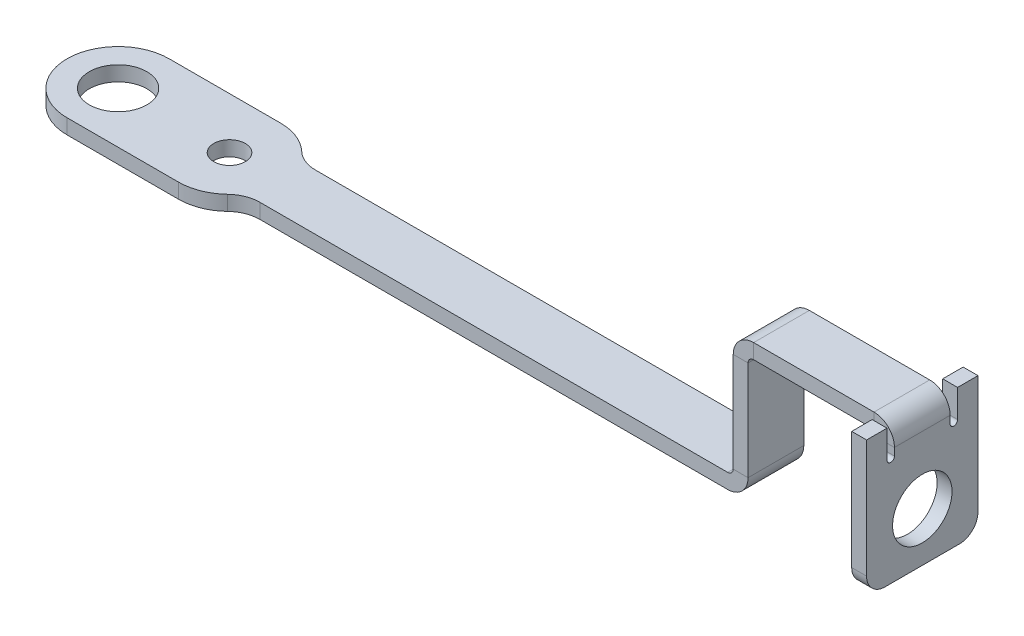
ISO-10303-21;
HEADER;
FILE_DESCRIPTION(('STEP AP214'),'2;1');
FILE_NAME('part.step','',(''),(''),'','','');
FILE_SCHEMA(('AUTOMOTIVE_DESIGN { 1 0 10303 214 1 1 1 1 }'));
ENDSEC;
DATA;
#1=APPLICATION_CONTEXT('core data for automotive mechanical design processes');
#2=APPLICATION_PROTOCOL_DEFINITION('international standard','automotive_design',2000,#1);
#3=PRODUCT_CONTEXT('',#1,'mechanical');
#4=PRODUCT('Part','Part','',(#3));
#5=PRODUCT_RELATED_PRODUCT_CATEGORY('part','',(#4));
#6=PRODUCT_DEFINITION_FORMATION('','',#4);
#7=PRODUCT_DEFINITION_CONTEXT('part definition',#1,'design');
#8=PRODUCT_DEFINITION('design','',#6,#7);
#9=PRODUCT_DEFINITION_SHAPE('','',#8);
#10=(LENGTH_UNIT() NAMED_UNIT(*) SI_UNIT(.MILLI.,.METRE.));
#11=(NAMED_UNIT(*) PLANE_ANGLE_UNIT() SI_UNIT($,.RADIAN.));
#12=(NAMED_UNIT(*) SI_UNIT($,.STERADIAN.) SOLID_ANGLE_UNIT());
#13=UNCERTAINTY_MEASURE_WITH_UNIT(LENGTH_MEASURE(1.E-05),#10,'distance_accuracy_value','');
#14=(GEOMETRIC_REPRESENTATION_CONTEXT(3) GLOBAL_UNCERTAINTY_ASSIGNED_CONTEXT((#13)) GLOBAL_UNIT_ASSIGNED_CONTEXT((#10,
#11,#12)) REPRESENTATION_CONTEXT('',''));
#15=CARTESIAN_POINT('',(0.,0.,0.));
#16=DIRECTION('',(0.,0.,1.));
#17=DIRECTION('',(1.,0.,0.));
#18=AXIS2_PLACEMENT_3D('',#15,#16,#17);
#19=CARTESIAN_POINT('',(-45.25,0.0500000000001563,2.74999999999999));
#20=DIRECTION('',(0.,0.,-1.));
#21=DIRECTION('',(-1.,0.,0.));
#22=AXIS2_PLACEMENT_3D('',#19,#20,#21);
#23=PLANE('',#22);
#24=DIRECTION('',(1.,0.,0.));
#25=VECTOR('',#24,1.);
#26=CARTESIAN_POINT('',(-45.25,0.850000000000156,2.74999999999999));
#27=LINE('',#26,#25);
#28=CARTESIAN_POINT('',(-36.5,0.850000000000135,2.75));
#29=VERTEX_POINT('',#28);
#30=CARTESIAN_POINT('',(-42.5,0.850000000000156,2.75));
#31=VERTEX_POINT('',#30);
#32=EDGE_CURVE('E639',#29,#31,#27,.F.);
#33=ORIENTED_EDGE('',*,*,#32,.T.);
#34=DIRECTION('',(0.,-1.,0.));
#35=VECTOR('',#34,1.);
#36=CARTESIAN_POINT('',(-42.5,7.60000000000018,2.75));
#37=LINE('',#36,#35);
#38=CARTESIAN_POINT('',(-42.5,0.0500000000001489,2.74999999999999));
#39=VERTEX_POINT('',#38);
#40=EDGE_CURVE('E611',#31,#39,#37,.T.);
#41=ORIENTED_EDGE('',*,*,#40,.T.);
#42=DIRECTION('',(-1.,0.,0.));
#43=VECTOR('',#42,1.);
#44=CARTESIAN_POINT('',(0.,0.0500000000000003,2.75));
#45=LINE('',#44,#43);
#46=CARTESIAN_POINT('',(-36.5000000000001,0.0500000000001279,2.75));
#47=VERTEX_POINT('',#46);
#48=EDGE_CURVE('E635',#47,#39,#45,.T.);
#49=ORIENTED_EDGE('',*,*,#48,.F.);
#50=DIRECTION('',(0.,-1.,0.));
#51=VECTOR('',#50,1.);
#52=CARTESIAN_POINT('',(-36.5,7.60000000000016,2.75));
#53=LINE('',#52,#51);
#54=EDGE_CURVE('E614',#29,#47,#53,.T.);
#55=ORIENTED_EDGE('',*,*,#54,.F.);
#56=EDGE_LOOP('',(#33,#41,#49,#55));
#57=FACE_BOUND('',#56,.T.);
#58=ADVANCED_FACE('F261',(#57),#23,.F.);
#59=CARTESIAN_POINT('',(0.,0.0500000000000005,0.));
#60=DIRECTION('',(0.,1.,0.));
#61=DIRECTION('',(-1.,0.,0.));
#62=AXIS2_PLACEMENT_3D('',#59,#60,#61);
#63=PLANE('',#62);
#64=CARTESIAN_POINT('',(-36.5000000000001,0.0500000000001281,0.));
#65=DIRECTION('',(0.,-1.,0.));
#66=DIRECTION('',(1.,0.,0.));
#67=AXIS2_PLACEMENT_3D('',#64,#65,#66);
#68=CIRCLE('',#67,0.849999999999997);
#69=CARTESIAN_POINT('',(-35.6500000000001,0.0500000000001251,0.));
#70=VERTEX_POINT('',#69);
#71=EDGE_CURVE('E625',#70,#70,#68,.T.);
#72=ORIENTED_EDGE('',*,*,#71,.F.);
#73=EDGE_LOOP('',(#72));
#74=FACE_BOUND('',#73,.T.);
#75=CARTESIAN_POINT('',(-42.5,0.0500000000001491,0.));
#76=DIRECTION('',(0.,-1.,0.));
#77=DIRECTION('',(1.,0.,0.));
#78=AXIS2_PLACEMENT_3D('',#75,#76,#77);
#79=CIRCLE('',#78,1.55);
#80=CARTESIAN_POINT('',(-40.95,0.0500000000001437,0.));
#81=VERTEX_POINT('',#80);
#82=EDGE_CURVE('E628',#81,#81,#79,.T.);
#83=ORIENTED_EDGE('',*,*,#82,.F.);
#84=EDGE_LOOP('',(#83));
#85=FACE_BOUND('',#84,.T.);
#86=CARTESIAN_POINT('',(-42.5,0.0500000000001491,0.));
#87=DIRECTION('',(0.,-1.,0.));
#88=DIRECTION('',(1.,0.,0.));
#89=AXIS2_PLACEMENT_3D('',#86,#87,#88);
#90=CIRCLE('',#89,2.74999999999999);
#91=CARTESIAN_POINT('',(-42.5,0.0500000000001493,-2.74999999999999));
#92=VERTEX_POINT('',#91);
#93=EDGE_CURVE('E623',#39,#92,#90,.T.);
#94=ORIENTED_EDGE('',*,*,#93,.T.);
#95=DIRECTION('',(-1.,0.,0.));
#96=VECTOR('',#95,1.);
#97=CARTESIAN_POINT('',(0.,0.0500000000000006,-2.75));
#98=LINE('',#97,#96);
#99=CARTESIAN_POINT('',(-36.5000000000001,0.0500000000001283,-2.75));
#100=VERTEX_POINT('',#99);
#101=EDGE_CURVE('E501',#100,#92,#98,.T.);
#102=ORIENTED_EDGE('',*,*,#101,.F.);
#103=CARTESIAN_POINT('',(-36.5000000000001,0.0500000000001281,0.));
#104=DIRECTION('',(0.,1.,0.));
#105=DIRECTION('',(1.,0.,0.));
#106=AXIS2_PLACEMENT_3D('',#103,#104,#105);
#107=CIRCLE('',#106,2.75);
#108=CARTESIAN_POINT('',(-34.6067361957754,0.0500000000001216,-1.99450549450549));
#109=VERTEX_POINT('',#108);
#110=EDGE_CURVE('E498',#109,#100,#107,.T.);
#111=ORIENTED_EDGE('',*,*,#110,.F.);
#112=CARTESIAN_POINT('',(-33.3675089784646,0.0500000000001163,-3.3));
#113=DIRECTION('',(0.,-1.,0.));
#114=DIRECTION('',(-1.,0.,0.));
#115=AXIS2_PLACEMENT_3D('',#112,#113,#114);
#116=CIRCLE('',#115,1.8);
#117=CARTESIAN_POINT('',(-33.3675089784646,0.0500000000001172,-1.5));
#118=VERTEX_POINT('',#117);
#119=EDGE_CURVE('E496',#118,#109,#116,.T.);
#120=ORIENTED_EDGE('',*,*,#119,.F.);
#121=DIRECTION('',(-1.,0.,0.));
#122=VECTOR('',#121,1.);
#123=CARTESIAN_POINT('',(-8.18000000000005,0.0500000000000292,-1.5));
#124=LINE('',#123,#122);
#125=CARTESIAN_POINT('',(-8.18000000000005,0.0500000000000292,-1.5));
#126=VERTEX_POINT('',#125);
#127=EDGE_CURVE('E486',#126,#118,#124,.T.);
#128=ORIENTED_EDGE('',*,*,#127,.F.);
#129=DIRECTION('',(0.,0.,1.));
#130=VECTOR('',#129,1.);
#131=CARTESIAN_POINT('',(-8.18000000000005,0.0500000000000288,1.5));
#132=LINE('',#131,#130);
#133=CARTESIAN_POINT('',(-8.18000000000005,0.050000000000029,1.5));
#134=VERTEX_POINT('',#133);
#135=EDGE_CURVE('E469',#126,#134,#132,.T.);
#136=ORIENTED_EDGE('',*,*,#135,.T.);
#137=DIRECTION('',(-1.,0.,0.));
#138=VECTOR('',#137,1.);
#139=CARTESIAN_POINT('',(-8.18000000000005,0.050000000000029,1.5));
#140=LINE('',#139,#138);
#141=CARTESIAN_POINT('',(-33.3675089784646,0.0500000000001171,1.5));
#142=VERTEX_POINT('',#141);
#143=EDGE_CURVE('E621',#134,#142,#140,.T.);
#144=ORIENTED_EDGE('',*,*,#143,.T.);
#145=CARTESIAN_POINT('',(-33.3675089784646,0.0500000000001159,3.3));
#146=DIRECTION('',(0.,1.,0.));
#147=DIRECTION('',(-1.,0.,0.));
#148=AXIS2_PLACEMENT_3D('',#145,#146,#147);
#149=CIRCLE('',#148,1.8);
#150=CARTESIAN_POINT('',(-34.6067361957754,0.0500000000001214,1.99450549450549));
#151=VERTEX_POINT('',#150);
#152=EDGE_CURVE('E761',#142,#151,#149,.T.);
#153=ORIENTED_EDGE('',*,*,#152,.T.);
#154=CARTESIAN_POINT('',(-36.5000000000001,0.0500000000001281,0.));
#155=DIRECTION('',(0.,-1.,0.));
#156=DIRECTION('',(1.,0.,0.));
#157=AXIS2_PLACEMENT_3D('',#154,#155,#156);
#158=CIRCLE('',#157,2.75);
#159=EDGE_CURVE('E617',#151,#47,#158,.T.);
#160=ORIENTED_EDGE('',*,*,#159,.T.);
#161=ORIENTED_EDGE('',*,*,#48,.T.);
#162=EDGE_LOOP('',(#94,#102,#111,#120,#128,#136,#144,#153,#160,#161));
#163=FACE_BOUND('',#162,.T.);
#164=ADVANCED_FACE('F493',(#74,#85,#163),#63,.F.);
#165=CARTESIAN_POINT('',(0.,0.850000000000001,0.));
#166=DIRECTION('',(0.,1.,0.));
#167=DIRECTION('',(-1.,0.,0.));
#168=AXIS2_PLACEMENT_3D('',#165,#166,#167);
#169=PLANE('',#168);
#170=CARTESIAN_POINT('',(-36.5,0.850000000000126,0.));
#171=DIRECTION('',(0.,1.,0.));
#172=DIRECTION('',(-1.,0.,0.));
#173=AXIS2_PLACEMENT_3D('',#170,#171,#172);
#174=CIRCLE('',#173,0.849999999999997);
#175=CARTESIAN_POINT('',(-37.3500000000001,0.850000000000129,0.));
#176=VERTEX_POINT('',#175);
#177=EDGE_CURVE('E753',#176,#176,#174,.T.);
#178=ORIENTED_EDGE('',*,*,#177,.F.);
#179=EDGE_LOOP('',(#178));
#180=FACE_BOUND('',#179,.T.);
#181=CARTESIAN_POINT('',(-42.5,0.850000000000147,0.));
#182=DIRECTION('',(0.,1.,0.));
#183=DIRECTION('',(-1.,0.,0.));
#184=AXIS2_PLACEMENT_3D('',#181,#182,#183);
#185=CIRCLE('',#184,1.55);
#186=CARTESIAN_POINT('',(-44.05,0.850000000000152,0.));
#187=VERTEX_POINT('',#186);
#188=EDGE_CURVE('E745',#187,#187,#185,.T.);
#189=ORIENTED_EDGE('',*,*,#188,.F.);
#190=EDGE_LOOP('',(#189));
#191=FACE_BOUND('',#190,.T.);
#192=DIRECTION('',(1.,0.,0.));
#193=VECTOR('',#192,1.);
#194=CARTESIAN_POINT('',(-45.25,0.850000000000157,-2.74999999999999));
#195=LINE('',#194,#193);
#196=CARTESIAN_POINT('',(-36.5,0.850000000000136,-2.75));
#197=VERTEX_POINT('',#196);
#198=CARTESIAN_POINT('',(-42.5,0.850000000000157,-2.75));
#199=VERTEX_POINT('',#198);
#200=EDGE_CURVE('E497',#197,#199,#195,.F.);
#201=ORIENTED_EDGE('',*,*,#200,.T.);
#202=CARTESIAN_POINT('',(-42.5,0.850000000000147,0.));
#203=DIRECTION('',(0.,1.,0.));
#204=DIRECTION('',(-1.,0.,0.));
#205=AXIS2_PLACEMENT_3D('',#202,#203,#204);
#206=CIRCLE('',#205,2.74999999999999);
#207=EDGE_CURVE('E631',#199,#31,#206,.T.);
#208=ORIENTED_EDGE('',*,*,#207,.T.);
#209=ORIENTED_EDGE('',*,*,#32,.F.);
#210=CARTESIAN_POINT('',(-36.5,0.850000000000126,0.));
#211=DIRECTION('',(0.,1.,0.));
#212=DIRECTION('',(-1.,0.,0.));
#213=AXIS2_PLACEMENT_3D('',#210,#211,#212);
#214=CIRCLE('',#213,2.75);
#215=CARTESIAN_POINT('',(-34.6067361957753,0.850000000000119,1.99450549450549));
#216=VERTEX_POINT('',#215);
#217=EDGE_CURVE('E748',#29,#216,#214,.T.);
#218=ORIENTED_EDGE('',*,*,#217,.T.);
#219=CARTESIAN_POINT('',(-33.3675089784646,0.850000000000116,3.3));
#220=DIRECTION('',(0.,1.,0.));
#221=DIRECTION('',(-1.,0.,0.));
#222=AXIS2_PLACEMENT_3D('',#219,#220,#221);
#223=CIRCLE('',#222,1.8);
#224=CARTESIAN_POINT('',(-33.3675089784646,0.850000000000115,1.5));
#225=VERTEX_POINT('',#224);
#226=EDGE_CURVE('E763',#216,#225,#223,.F.);
#227=ORIENTED_EDGE('',*,*,#226,.T.);
#228=DIRECTION('',(1.,0.,0.));
#229=VECTOR('',#228,1.);
#230=CARTESIAN_POINT('',(0.,0.85,1.5));
#231=LINE('',#230,#229);
#232=CARTESIAN_POINT('',(-8.18000000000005,0.850000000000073,1.5));
#233=VERTEX_POINT('',#232);
#234=EDGE_CURVE('E751',#225,#233,#231,.T.);
#235=ORIENTED_EDGE('',*,*,#234,.T.);
#236=DIRECTION('',(0.,0.,1.));
#237=VECTOR('',#236,1.);
#238=CARTESIAN_POINT('',(-8.18000000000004,0.850000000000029,0.));
#239=LINE('',#238,#237);
#240=CARTESIAN_POINT('',(-8.18000000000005,0.850000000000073,-1.5));
#241=VERTEX_POINT('',#240);
#242=EDGE_CURVE('E634',#241,#233,#239,.T.);
#243=ORIENTED_EDGE('',*,*,#242,.F.);
#244=DIRECTION('',(1.,0.,0.));
#245=VECTOR('',#244,1.);
#246=CARTESIAN_POINT('',(0.,0.850000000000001,-1.5));
#247=LINE('',#246,#245);
#248=CARTESIAN_POINT('',(-33.3675089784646,0.850000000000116,-1.5));
#249=VERTEX_POINT('',#248);
#250=EDGE_CURVE('E586',#249,#241,#247,.T.);
#251=ORIENTED_EDGE('',*,*,#250,.F.);
#252=CARTESIAN_POINT('',(-33.3675089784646,0.850000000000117,-3.3));
#253=DIRECTION('',(0.,-1.,0.));
#254=DIRECTION('',(-1.,0.,0.));
#255=AXIS2_PLACEMENT_3D('',#252,#253,#254);
#256=CIRCLE('',#255,1.8);
#257=CARTESIAN_POINT('',(-34.6067361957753,0.850000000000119,-1.99450549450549));
#258=VERTEX_POINT('',#257);
#259=EDGE_CURVE('E593',#258,#249,#256,.F.);
#260=ORIENTED_EDGE('',*,*,#259,.F.);
#261=CARTESIAN_POINT('',(-36.5,0.850000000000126,0.));
#262=DIRECTION('',(0.,-1.,0.));
#263=DIRECTION('',(-1.,0.,0.));
#264=AXIS2_PLACEMENT_3D('',#261,#262,#263);
#265=CIRCLE('',#264,2.75);
#266=EDGE_CURVE('E583',#197,#258,#265,.T.);
#267=ORIENTED_EDGE('',*,*,#266,.F.);
#268=EDGE_LOOP('',(#201,#208,#209,#218,#227,#235,#243,#251,#260,#267));
#269=FACE_BOUND('',#268,.T.);
#270=ADVANCED_FACE('F895',(#180,#191,#269),#169,.T.);
#271=CARTESIAN_POINT('',(-7.88,6.80000000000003,1.5));
#272=DIRECTION('',(0.,0.,-1.));
#273=DIRECTION('',(-1.,0.,0.));
#274=AXIS2_PLACEMENT_3D('',#271,#272,#273);
#275=PLANE('',#274);
#276=DIRECTION('',(1.,0.,0.));
#277=VECTOR('',#276,1.);
#278=CARTESIAN_POINT('',(-7.88000000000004,1.15000000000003,1.5));
#279=LINE('',#278,#277);
#280=CARTESIAN_POINT('',(-7.88000000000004,1.15000000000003,1.5));
#281=VERTEX_POINT('',#280);
#282=CARTESIAN_POINT('',(-7.08000000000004,1.15000000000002,1.5));
#283=VERTEX_POINT('',#282);
#284=EDGE_CURVE('E645',#281,#283,#279,.T.);
#285=ORIENTED_EDGE('',*,*,#284,.T.);
#286=DIRECTION('',(0.,-1.,0.));
#287=VECTOR('',#286,1.);
#288=CARTESIAN_POINT('',(-7.08,6.80000000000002,1.5));
#289=LINE('',#288,#287);
#290=CARTESIAN_POINT('',(-7.08,6.50000000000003,1.5));
#291=VERTEX_POINT('',#290);
#292=EDGE_CURVE('E657',#283,#291,#289,.F.);
#293=ORIENTED_EDGE('',*,*,#292,.T.);
#294=DIRECTION('',(1.,0.,0.));
#295=VECTOR('',#294,1.);
#296=CARTESIAN_POINT('',(-7.88000000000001,6.50000000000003,1.5));
#297=LINE('',#296,#295);
#298=CARTESIAN_POINT('',(-7.88000000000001,6.50000000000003,1.5));
#299=VERTEX_POINT('',#298);
#300=EDGE_CURVE('E653',#291,#299,#297,.F.);
#301=ORIENTED_EDGE('',*,*,#300,.T.);
#302=DIRECTION('',(0.,1.,0.));
#303=VECTOR('',#302,1.);
#304=CARTESIAN_POINT('',(-7.88000000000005,0.,1.5));
#305=LINE('',#304,#303);
#306=EDGE_CURVE('E654',#281,#299,#305,.T.);
#307=ORIENTED_EDGE('',*,*,#306,.F.);
#308=EDGE_LOOP('',(#285,#293,#301,#307));
#309=FACE_BOUND('',#308,.T.);
#310=ADVANCED_FACE('F840',(#309),#275,.F.);
#311=CARTESIAN_POINT('',(-7.88000000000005,0.,0.));
#312=DIRECTION('',(1.,0.,0.));
#313=DIRECTION('',(0.,1.,0.));
#314=AXIS2_PLACEMENT_3D('',#311,#312,#313);
#315=PLANE('',#314);
#316=DIRECTION('',(0.,0.,1.));
#317=VECTOR('',#316,1.);
#318=CARTESIAN_POINT('',(-7.88000000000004,1.15000000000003,1.5));
#319=LINE('',#318,#317);
#320=CARTESIAN_POINT('',(-7.88000000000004,1.15000000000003,-1.5));
#321=VERTEX_POINT('',#320);
#322=EDGE_CURVE('E479',#281,#321,#319,.F.);
#323=ORIENTED_EDGE('',*,*,#322,.F.);
#324=ORIENTED_EDGE('',*,*,#306,.T.);
#325=DIRECTION('',(0.,0.,-1.));
#326=VECTOR('',#325,1.);
#327=CARTESIAN_POINT('',(-7.88000000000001,6.50000000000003,1.5));
#328=LINE('',#327,#326);
#329=CARTESIAN_POINT('',(-7.88000000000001,6.50000000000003,-1.5));
#330=VERTEX_POINT('',#329);
#331=EDGE_CURVE('E659',#330,#299,#328,.F.);
#332=ORIENTED_EDGE('',*,*,#331,.F.);
#333=DIRECTION('',(0.,1.,0.));
#334=VECTOR('',#333,1.);
#335=CARTESIAN_POINT('',(-7.88000000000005,0.,-1.5));
#336=LINE('',#335,#334);
#337=EDGE_CURVE('E512',#321,#330,#336,.T.);
#338=ORIENTED_EDGE('',*,*,#337,.F.);
#339=EDGE_LOOP('',(#323,#324,#332,#338));
#340=FACE_BOUND('',#339,.T.);
#341=ADVANCED_FACE('F837',(#340),#315,.F.);
#342=CARTESIAN_POINT('',(-7.08000000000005,0.,0.));
#343=DIRECTION('',(1.,0.,0.));
#344=DIRECTION('',(0.,1.,0.));
#345=AXIS2_PLACEMENT_3D('',#342,#343,#344);
#346=PLANE('',#345);
#347=ORIENTED_EDGE('',*,*,#292,.F.);
#348=DIRECTION('',(0.,0.,1.));
#349=VECTOR('',#348,1.);
#350=CARTESIAN_POINT('',(-7.08000000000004,1.15000000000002,1.5));
#351=LINE('',#350,#349);
#352=CARTESIAN_POINT('',(-7.08000000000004,1.15000000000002,-1.5));
#353=VERTEX_POINT('',#352);
#354=EDGE_CURVE('E644',#283,#353,#351,.F.);
#355=ORIENTED_EDGE('',*,*,#354,.T.);
#356=DIRECTION('',(0.,-1.,0.));
#357=VECTOR('',#356,1.);
#358=CARTESIAN_POINT('',(-7.08,6.80000000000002,-1.5));
#359=LINE('',#358,#357);
#360=CARTESIAN_POINT('',(-7.08,6.50000000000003,-1.5));
#361=VERTEX_POINT('',#360);
#362=EDGE_CURVE('E516',#353,#361,#359,.F.);
#363=ORIENTED_EDGE('',*,*,#362,.T.);
#364=DIRECTION('',(0.,0.,-1.));
#365=VECTOR('',#364,1.);
#366=CARTESIAN_POINT('',(-7.08,6.50000000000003,1.5));
#367=LINE('',#366,#365);
#368=EDGE_CURVE('E662',#291,#361,#367,.T.);
#369=ORIENTED_EDGE('',*,*,#368,.F.);
#370=EDGE_LOOP('',(#347,#355,#363,#369));
#371=FACE_BOUND('',#370,.T.);
#372=ADVANCED_FACE('F847',(#371),#346,.T.);
#373=CARTESIAN_POINT('',(0.,7.6,1.5));
#374=DIRECTION('',(0.,0.,-1.));
#375=DIRECTION('',(-1.,0.,0.));
#376=AXIS2_PLACEMENT_3D('',#373,#374,#375);
#377=PLANE('',#376);
#378=DIRECTION('',(0.,1.,0.));
#379=VECTOR('',#378,1.);
#380=CARTESIAN_POINT('',(-6.78,6.80000000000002,1.5));
#381=LINE('',#380,#379);
#382=CARTESIAN_POINT('',(-6.78,6.80000000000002,1.5));
#383=VERTEX_POINT('',#382);
#384=CARTESIAN_POINT('',(-6.78,7.60000000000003,1.5));
#385=VERTEX_POINT('',#384);
#386=EDGE_CURVE('E672',#383,#385,#381,.T.);
#387=ORIENTED_EDGE('',*,*,#386,.F.);
#388=DIRECTION('',(-1.,0.,0.));
#389=VECTOR('',#388,1.);
#390=CARTESIAN_POINT('',(0.,6.8,1.5));
#391=LINE('',#390,#389);
#392=CARTESIAN_POINT('',(-0.299999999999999,6.8,1.5));
#393=VERTEX_POINT('',#392);
#394=EDGE_CURVE('E683',#383,#393,#391,.F.);
#395=ORIENTED_EDGE('',*,*,#394,.T.);
#396=DIRECTION('',(0.,-1.,0.));
#397=VECTOR('',#396,1.);
#398=CARTESIAN_POINT('',(-0.299999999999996,7.6,1.5));
#399=LINE('',#398,#397);
#400=CARTESIAN_POINT('',(-0.299999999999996,7.6,1.5));
#401=VERTEX_POINT('',#400);
#402=EDGE_CURVE('E679',#393,#401,#399,.F.);
#403=ORIENTED_EDGE('',*,*,#402,.T.);
#404=DIRECTION('',(1.,0.,0.));
#405=VECTOR('',#404,1.);
#406=CARTESIAN_POINT('',(0.,7.6,1.5));
#407=LINE('',#406,#405);
#408=EDGE_CURVE('E680',#385,#401,#407,.T.);
#409=ORIENTED_EDGE('',*,*,#408,.F.);
#410=EDGE_LOOP('',(#387,#395,#403,#409));
#411=FACE_BOUND('',#410,.T.);
#412=ADVANCED_FACE('F824',(#411),#377,.F.);
#413=CARTESIAN_POINT('',(0.,7.6,0.));
#414=DIRECTION('',(0.,-1.,0.));
#415=DIRECTION('',(1.,0.,0.));
#416=AXIS2_PLACEMENT_3D('',#413,#414,#415);
#417=PLANE('',#416);
#418=DIRECTION('',(0.,0.,-1.));
#419=VECTOR('',#418,1.);
#420=CARTESIAN_POINT('',(-6.78,7.60000000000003,0.));
#421=LINE('',#420,#419);
#422=CARTESIAN_POINT('',(-6.78,7.60000000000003,-1.5));
#423=VERTEX_POINT('',#422);
#424=EDGE_CURVE('E666',#423,#385,#421,.F.);
#425=ORIENTED_EDGE('',*,*,#424,.T.);
#426=ORIENTED_EDGE('',*,*,#408,.T.);
#427=DIRECTION('',(0.,0.,-1.));
#428=VECTOR('',#427,1.);
#429=CARTESIAN_POINT('',(-0.299999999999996,7.6,1.5));
#430=LINE('',#429,#428);
#431=CARTESIAN_POINT('',(-0.299999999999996,7.6,-1.5));
#432=VERTEX_POINT('',#431);
#433=EDGE_CURVE('E685',#432,#401,#430,.F.);
#434=ORIENTED_EDGE('',*,*,#433,.F.);
#435=DIRECTION('',(1.,0.,0.));
#436=VECTOR('',#435,1.);
#437=CARTESIAN_POINT('',(0.,7.6,-1.5));
#438=LINE('',#437,#436);
#439=EDGE_CURVE('E530',#423,#432,#438,.T.);
#440=ORIENTED_EDGE('',*,*,#439,.F.);
#441=EDGE_LOOP('',(#425,#426,#434,#440));
#442=FACE_BOUND('',#441,.T.);
#443=ADVANCED_FACE('F821',(#442),#417,.F.);
#444=CARTESIAN_POINT('',(0.,6.8,0.));
#445=DIRECTION('',(0.,-1.,0.));
#446=DIRECTION('',(1.,0.,0.));
#447=AXIS2_PLACEMENT_3D('',#444,#445,#446);
#448=PLANE('',#447);
#449=ORIENTED_EDGE('',*,*,#394,.F.);
#450=DIRECTION('',(0.,0.,-1.));
#451=VECTOR('',#450,1.);
#452=CARTESIAN_POINT('',(-6.78,6.80000000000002,0.));
#453=LINE('',#452,#451);
#454=CARTESIAN_POINT('',(-6.78,6.80000000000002,-1.5));
#455=VERTEX_POINT('',#454);
#456=EDGE_CURVE('E656',#455,#383,#453,.F.);
#457=ORIENTED_EDGE('',*,*,#456,.F.);
#458=DIRECTION('',(-1.,0.,0.));
#459=VECTOR('',#458,1.);
#460=CARTESIAN_POINT('',(0.,6.8,-1.5));
#461=LINE('',#460,#459);
#462=CARTESIAN_POINT('',(-0.299999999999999,6.8,-1.5));
#463=VERTEX_POINT('',#462);
#464=EDGE_CURVE('E534',#455,#463,#461,.F.);
#465=ORIENTED_EDGE('',*,*,#464,.T.);
#466=DIRECTION('',(0.,0.,-1.));
#467=VECTOR('',#466,1.);
#468=CARTESIAN_POINT('',(-0.299999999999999,6.8,1.5));
#469=LINE('',#468,#467);
#470=EDGE_CURVE('E688',#393,#463,#469,.T.);
#471=ORIENTED_EDGE('',*,*,#470,.F.);
#472=EDGE_LOOP('',(#449,#457,#465,#471));
#473=FACE_BOUND('',#472,.T.);
#474=ADVANCED_FACE('F860',(#473),#448,.T.);
#475=CARTESIAN_POINT('',(0.8,0.25,3.));
#476=DIRECTION('',(-1.,0.,0.));
#477=DIRECTION('',(0.,0.,1.));
#478=AXIS2_PLACEMENT_3D('',#475,#476,#477);
#479=PLANE('',#478);
#480=DIRECTION('',(0.,1.,0.));
#481=VECTOR('',#480,1.);
#482=CARTESIAN_POINT('',(0.8,0.25,-1.5));
#483=LINE('',#482,#481);
#484=CARTESIAN_POINT('',(0.8,6.1,-1.5));
#485=VERTEX_POINT('',#484);
#486=CARTESIAN_POINT('',(0.8,6.5,-1.5));
#487=VERTEX_POINT('',#486);
#488=EDGE_CURVE('E567',#485,#487,#483,.T.);
#489=ORIENTED_EDGE('',*,*,#488,.T.);
#490=DIRECTION('',(0.,0.,-1.));
#491=VECTOR('',#490,1.);
#492=CARTESIAN_POINT('',(0.8,6.5,0.));
#493=LINE('',#492,#491);
#494=CARTESIAN_POINT('',(0.8,6.5,1.5));
#495=VERTEX_POINT('',#494);
#496=EDGE_CURVE('E692',#487,#495,#493,.F.);
#497=ORIENTED_EDGE('',*,*,#496,.T.);
#498=DIRECTION('',(0.,1.,0.));
#499=VECTOR('',#498,1.);
#500=CARTESIAN_POINT('',(0.8,0.25,1.5));
#501=LINE('',#500,#499);
#502=CARTESIAN_POINT('',(0.8,6.1,1.5));
#503=VERTEX_POINT('',#502);
#504=EDGE_CURVE('E726',#503,#495,#501,.T.);
#505=ORIENTED_EDGE('',*,*,#504,.F.);
#506=CARTESIAN_POINT('',(0.8,6.1,1.7));
#507=DIRECTION('',(-1.,0.,0.));
#508=DIRECTION('',(0.,0.,1.));
#509=AXIS2_PLACEMENT_3D('',#506,#507,#508);
#510=CIRCLE('',#509,0.2);
#511=CARTESIAN_POINT('',(0.8,6.1,1.9));
#512=VERTEX_POINT('',#511);
#513=EDGE_CURVE('E724',#512,#503,#510,.F.);
#514=ORIENTED_EDGE('',*,*,#513,.F.);
#515=DIRECTION('',(0.,-1.,0.));
#516=VECTOR('',#515,1.);
#517=CARTESIAN_POINT('',(0.8,0.25,1.9));
#518=LINE('',#517,#516);
#519=CARTESIAN_POINT('',(0.8,7.6,1.9));
#520=VERTEX_POINT('',#519);
#521=EDGE_CURVE('E710',#520,#512,#518,.T.);
#522=ORIENTED_EDGE('',*,*,#521,.F.);
#523=DIRECTION('',(0.,0.,-1.));
#524=VECTOR('',#523,1.);
#525=CARTESIAN_POINT('',(0.8,7.6,3.));
#526=LINE('',#525,#524);
#527=CARTESIAN_POINT('',(0.8,7.6,3.));
#528=VERTEX_POINT('',#527);
#529=EDGE_CURVE('E742',#528,#520,#526,.T.);
#530=ORIENTED_EDGE('',*,*,#529,.F.);
#531=DIRECTION('',(0.,1.,0.));
#532=VECTOR('',#531,1.);
#533=CARTESIAN_POINT('',(0.8,0.25,3.));
#534=LINE('',#533,#532);
#535=CARTESIAN_POINT('',(0.8,1.25,3.));
#536=VERTEX_POINT('',#535);
#537=EDGE_CURVE('E728',#536,#528,#534,.T.);
#538=ORIENTED_EDGE('',*,*,#537,.F.);
#539=CARTESIAN_POINT('',(0.8,1.25,2.));
#540=DIRECTION('',(-1.,0.,0.));
#541=DIRECTION('',(0.,0.,1.));
#542=AXIS2_PLACEMENT_3D('',#539,#540,#541);
#543=CIRCLE('',#542,1.);
#544=CARTESIAN_POINT('',(0.8,0.25,2.));
#545=VERTEX_POINT('',#544);
#546=EDGE_CURVE('E15',#536,#545,#543,.F.);
#547=ORIENTED_EDGE('',*,*,#546,.T.);
#548=DIRECTION('',(0.,0.,-1.));
#549=VECTOR('',#548,1.);
#550=CARTESIAN_POINT('',(0.8,0.25,3.));
#551=LINE('',#550,#549);
#552=CARTESIAN_POINT('',(0.8,0.25,-2.));
#553=VERTEX_POINT('',#552);
#554=EDGE_CURVE('E735',#545,#553,#551,.T.);
#555=ORIENTED_EDGE('',*,*,#554,.T.);
#556=CARTESIAN_POINT('',(0.8,1.25,-2.));
#557=DIRECTION('',(1.,0.,0.));
#558=DIRECTION('',(0.,0.,-1.));
#559=AXIS2_PLACEMENT_3D('',#556,#557,#558);
#560=CIRCLE('',#559,1.);
#561=CARTESIAN_POINT('',(0.8,1.25,-3.));
#562=VERTEX_POINT('',#561);
#563=EDGE_CURVE('E604',#562,#553,#560,.F.);
#564=ORIENTED_EDGE('',*,*,#563,.F.);
#565=DIRECTION('',(0.,1.,0.));
#566=VECTOR('',#565,1.);
#567=CARTESIAN_POINT('',(0.8,0.25,-3.));
#568=LINE('',#567,#566);
#569=CARTESIAN_POINT('',(0.8,7.6,-3.));
#570=VERTEX_POINT('',#569);
#571=EDGE_CURVE('E570',#562,#570,#568,.T.);
#572=ORIENTED_EDGE('',*,*,#571,.T.);
#573=DIRECTION('',(0.,0.,1.));
#574=VECTOR('',#573,1.);
#575=CARTESIAN_POINT('',(0.8,7.6,-3.));
#576=LINE('',#575,#574);
#577=CARTESIAN_POINT('',(0.8,7.6,-1.9));
#578=VERTEX_POINT('',#577);
#579=EDGE_CURVE('E580',#570,#578,#576,.T.);
#580=ORIENTED_EDGE('',*,*,#579,.T.);
#581=DIRECTION('',(0.,-1.,0.));
#582=VECTOR('',#581,1.);
#583=CARTESIAN_POINT('',(0.8,0.25,-1.9));
#584=LINE('',#583,#582);
#585=CARTESIAN_POINT('',(0.8,6.1,-1.9));
#586=VERTEX_POINT('',#585);
#587=EDGE_CURVE('E551',#578,#586,#584,.T.);
#588=ORIENTED_EDGE('',*,*,#587,.T.);
#589=CARTESIAN_POINT('',(0.8,6.1,-1.7));
#590=DIRECTION('',(1.,0.,0.));
#591=DIRECTION('',(0.,0.,-1.));
#592=AXIS2_PLACEMENT_3D('',#589,#590,#591);
#593=CIRCLE('',#592,0.2);
#594=EDGE_CURVE('E564',#586,#485,#593,.F.);
#595=ORIENTED_EDGE('',*,*,#594,.T.);
#596=EDGE_LOOP('',(#489,#497,#505,#514,#522,#530,#538,#547,#555,#564,#572,#580,#588,#595));
#597=FACE_BOUND('',#596,.T.);
#598=CARTESIAN_POINT('',(0.8,2.9000000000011,-2.78943534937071E-12));
#599=DIRECTION('',(1.,0.,0.));
#600=DIRECTION('',(0.,0.,-1.));
#601=AXIS2_PLACEMENT_3D('',#598,#599,#600);
#602=CIRCLE('',#601,1.60000000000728);
#603=CARTESIAN_POINT('',(0.799999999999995,2.9000000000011,-1.60000000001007));
#604=VERTEX_POINT('',#603);
#605=EDGE_CURVE('E607',#604,#604,#602,.T.);
#606=ORIENTED_EDGE('',*,*,#605,.F.);
#607=EDGE_LOOP('',(#606));
#608=FACE_BOUND('',#607,.T.);
#609=ADVANCED_FACE('F785',(#597,#608),#479,.F.);
#610=CARTESIAN_POINT('',(0.,7.6,3.));
#611=DIRECTION('',(0.,1.,0.));
#612=DIRECTION('',(0.,0.,1.));
#613=AXIS2_PLACEMENT_3D('',#610,#611,#612);
#614=PLANE('',#613);
#615=ORIENTED_EDGE('',*,*,#529,.T.);
#616=DIRECTION('',(1.,0.,0.));
#617=VECTOR('',#616,1.);
#618=CARTESIAN_POINT('',(0.,7.6,1.9));
#619=LINE('',#618,#617);
#620=CARTESIAN_POINT('',(0.,7.6,1.9));
#621=VERTEX_POINT('',#620);
#622=EDGE_CURVE('E717',#621,#520,#619,.T.);
#623=ORIENTED_EDGE('',*,*,#622,.F.);
#624=DIRECTION('',(0.,0.,-1.));
#625=VECTOR('',#624,1.);
#626=CARTESIAN_POINT('',(0.,7.6,3.));
#627=LINE('',#626,#625);
#628=CARTESIAN_POINT('',(0.,7.6,3.));
#629=VERTEX_POINT('',#628);
#630=EDGE_CURVE('E739',#629,#621,#627,.T.);
#631=ORIENTED_EDGE('',*,*,#630,.F.);
#632=DIRECTION('',(1.,0.,0.));
#633=VECTOR('',#632,1.);
#634=CARTESIAN_POINT('',(0.,7.6,3.));
#635=LINE('',#634,#633);
#636=EDGE_CURVE('E730',#629,#528,#635,.T.);
#637=ORIENTED_EDGE('',*,*,#636,.T.);
#638=EDGE_LOOP('',(#615,#623,#631,#637));
#639=FACE_BOUND('',#638,.T.);
#640=ADVANCED_FACE('F874',(#639),#614,.T.);
#641=CARTESIAN_POINT('',(0.,0.25,3.));
#642=DIRECTION('',(-1.,0.,0.));
#643=DIRECTION('',(0.,0.,1.));
#644=AXIS2_PLACEMENT_3D('',#641,#642,#643);
#645=PLANE('',#644);
#646=DIRECTION('',(0.,0.,-1.));
#647=VECTOR('',#646,1.);
#648=CARTESIAN_POINT('',(0.,6.5,0.));
#649=LINE('',#648,#647);
#650=CARTESIAN_POINT('',(0.,6.5,-1.5));
#651=VERTEX_POINT('',#650);
#652=CARTESIAN_POINT('',(0.,6.5,1.5));
#653=VERTEX_POINT('',#652);
#654=EDGE_CURVE('E682',#651,#653,#649,.F.);
#655=ORIENTED_EDGE('',*,*,#654,.F.);
#656=DIRECTION('',(0.,-1.,0.));
#657=VECTOR('',#656,1.);
#658=CARTESIAN_POINT('',(0.,6.5,-1.5));
#659=LINE('',#658,#657);
#660=CARTESIAN_POINT('',(0.,6.1,-1.5));
#661=VERTEX_POINT('',#660);
#662=EDGE_CURVE('E548',#651,#661,#659,.T.);
#663=ORIENTED_EDGE('',*,*,#662,.T.);
#664=CARTESIAN_POINT('',(0.,6.1,-1.7));
#665=DIRECTION('',(1.,0.,0.));
#666=DIRECTION('',(0.,0.,-1.));
#667=AXIS2_PLACEMENT_3D('',#664,#665,#666);
#668=CIRCLE('',#667,0.2);
#669=CARTESIAN_POINT('',(0.,6.1,-1.9));
#670=VERTEX_POINT('',#669);
#671=EDGE_CURVE('E552',#661,#670,#668,.T.);
#672=ORIENTED_EDGE('',*,*,#671,.T.);
#673=DIRECTION('',(0.,1.,0.));
#674=VECTOR('',#673,1.);
#675=CARTESIAN_POINT('',(0.,6.1,-1.9));
#676=LINE('',#675,#674);
#677=CARTESIAN_POINT('',(0.,7.6,-1.9));
#678=VERTEX_POINT('',#677);
#679=EDGE_CURVE('E556',#670,#678,#676,.T.);
#680=ORIENTED_EDGE('',*,*,#679,.T.);
#681=DIRECTION('',(0.,0.,1.));
#682=VECTOR('',#681,1.);
#683=CARTESIAN_POINT('',(0.,7.6,-3.));
#684=LINE('',#683,#682);
#685=CARTESIAN_POINT('',(0.,7.6,-3.));
#686=VERTEX_POINT('',#685);
#687=EDGE_CURVE('E577',#686,#678,#684,.T.);
#688=ORIENTED_EDGE('',*,*,#687,.F.);
#689=DIRECTION('',(0.,1.,0.));
#690=VECTOR('',#689,1.);
#691=CARTESIAN_POINT('',(0.,0.25,-3.));
#692=LINE('',#691,#690);
#693=CARTESIAN_POINT('',(0.,1.25,-3.));
#694=VERTEX_POINT('',#693);
#695=EDGE_CURVE('E575',#694,#686,#692,.T.);
#696=ORIENTED_EDGE('',*,*,#695,.F.);
#697=CARTESIAN_POINT('',(0.,1.25,-2.));
#698=DIRECTION('',(1.,0.,0.));
#699=DIRECTION('',(0.,0.,-1.));
#700=AXIS2_PLACEMENT_3D('',#697,#698,#699);
#701=CIRCLE('',#700,1.);
#702=CARTESIAN_POINT('',(0.,0.25,-2.));
#703=VERTEX_POINT('',#702);
#704=EDGE_CURVE('E599',#703,#694,#701,.T.);
#705=ORIENTED_EDGE('',*,*,#704,.F.);
#706=DIRECTION('',(0.,0.,-1.));
#707=VECTOR('',#706,1.);
#708=CARTESIAN_POINT('',(0.,0.25,3.));
#709=LINE('',#708,#707);
#710=CARTESIAN_POINT('',(0.,0.25,2.));
#711=VERTEX_POINT('',#710);
#712=EDGE_CURVE('E737',#711,#703,#709,.T.);
#713=ORIENTED_EDGE('',*,*,#712,.F.);
#714=CARTESIAN_POINT('',(0.,1.25,2.));
#715=DIRECTION('',(-1.,0.,0.));
#716=DIRECTION('',(0.,0.,1.));
#717=AXIS2_PLACEMENT_3D('',#714,#715,#716);
#718=CIRCLE('',#717,1.);
#719=CARTESIAN_POINT('',(0.,1.25,3.));
#720=VERTEX_POINT('',#719);
#721=EDGE_CURVE('E283',#711,#720,#718,.T.);
#722=ORIENTED_EDGE('',*,*,#721,.T.);
#723=DIRECTION('',(0.,1.,0.));
#724=VECTOR('',#723,1.);
#725=CARTESIAN_POINT('',(0.,0.25,3.));
#726=LINE('',#725,#724);
#727=EDGE_CURVE('E733',#720,#629,#726,.T.);
#728=ORIENTED_EDGE('',*,*,#727,.T.);
#729=ORIENTED_EDGE('',*,*,#630,.T.);
#730=DIRECTION('',(0.,1.,0.));
#731=VECTOR('',#730,1.);
#732=CARTESIAN_POINT('',(0.,6.1,1.9));
#733=LINE('',#732,#731);
#734=CARTESIAN_POINT('',(0.,6.1,1.9));
#735=VERTEX_POINT('',#734);
#736=EDGE_CURVE('E715',#735,#621,#733,.T.);
#737=ORIENTED_EDGE('',*,*,#736,.F.);
#738=CARTESIAN_POINT('',(0.,6.1,1.7));
#739=DIRECTION('',(-1.,0.,0.));
#740=DIRECTION('',(0.,0.,1.));
#741=AXIS2_PLACEMENT_3D('',#738,#739,#740);
#742=CIRCLE('',#741,0.2);
#743=CARTESIAN_POINT('',(0.,6.1,1.5));
#744=VERTEX_POINT('',#743);
#745=EDGE_CURVE('E711',#744,#735,#742,.T.);
#746=ORIENTED_EDGE('',*,*,#745,.F.);
#747=DIRECTION('',(0.,-1.,0.));
#748=VECTOR('',#747,1.);
#749=CARTESIAN_POINT('',(0.,6.5,1.5));
#750=LINE('',#749,#748);
#751=EDGE_CURVE('E707',#653,#744,#750,.T.);
#752=ORIENTED_EDGE('',*,*,#751,.F.);
#753=EDGE_LOOP('',(#655,#663,#672,#680,#688,#696,#705,#713,#722,#728,#729,#737,#746,#752));
#754=FACE_BOUND('',#753,.T.);
#755=CARTESIAN_POINT('',(0.,2.9000000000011,-2.78943534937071E-12));
#756=DIRECTION('',(-1.,0.,0.));
#757=DIRECTION('',(0.,0.,1.));
#758=AXIS2_PLACEMENT_3D('',#755,#756,#757);
#759=CIRCLE('',#758,1.60000000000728);
#760=CARTESIAN_POINT('',(0.,2.9000000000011,-1.60000000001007));
#761=VERTEX_POINT('',#760);
#762=EDGE_CURVE('E608',#761,#761,#759,.F.);
#763=ORIENTED_EDGE('',*,*,#762,.T.);
#764=EDGE_LOOP('',(#763));
#765=FACE_BOUND('',#764,.T.);
#766=ADVANCED_FACE('F776',(#754,#765),#645,.T.);
#767=CARTESIAN_POINT('',(0.8,0.25,3.));
#768=DIRECTION('',(0.,-1.,0.));
#769=DIRECTION('',(0.,0.,-1.));
#770=AXIS2_PLACEMENT_3D('',#767,#768,#769);
#771=PLANE('',#770);
#772=ORIENTED_EDGE('',*,*,#554,.F.);
#773=DIRECTION('',(-1.,0.,0.));
#774=VECTOR('',#773,1.);
#775=CARTESIAN_POINT('',(0.,0.25,2.));
#776=LINE('',#775,#774);
#777=EDGE_CURVE('E765',#545,#711,#776,.T.);
#778=ORIENTED_EDGE('',*,*,#777,.T.);
#779=ORIENTED_EDGE('',*,*,#712,.T.);
#780=DIRECTION('',(-1.,0.,0.));
#781=VECTOR('',#780,1.);
#782=CARTESIAN_POINT('',(0.,0.25,-2.));
#783=LINE('',#782,#781);
#784=EDGE_CURVE('E596',#553,#703,#783,.T.);
#785=ORIENTED_EDGE('',*,*,#784,.F.);
#786=EDGE_LOOP('',(#772,#778,#779,#785));
#787=FACE_BOUND('',#786,.T.);
#788=ADVANCED_FACE('F771',(#787),#771,.T.);
#789=CARTESIAN_POINT('',(0.,0.,3.));
#790=DIRECTION('',(0.,0.,-1.));
#791=DIRECTION('',(-1.,0.,0.));
#792=AXIS2_PLACEMENT_3D('',#789,#790,#791);
#793=PLANE('',#792);
#794=ORIENTED_EDGE('',*,*,#727,.F.);
#795=DIRECTION('',(-1.,0.,0.));
#796=VECTOR('',#795,1.);
#797=CARTESIAN_POINT('',(0.8,1.25,3.));
#798=LINE('',#797,#796);
#799=EDGE_CURVE('E269',#720,#536,#798,.F.);
#800=ORIENTED_EDGE('',*,*,#799,.T.);
#801=ORIENTED_EDGE('',*,*,#537,.T.);
#802=ORIENTED_EDGE('',*,*,#636,.F.);
#803=EDGE_LOOP('',(#794,#800,#801,#802));
#804=FACE_BOUND('',#803,.T.);
#805=ADVANCED_FACE('F877',(#804),#793,.F.);
#806=CARTESIAN_POINT('',(0.,6.5,1.5));
#807=DIRECTION('',(0.,0.,1.));
#808=DIRECTION('',(1.,0.,0.));
#809=AXIS2_PLACEMENT_3D('',#806,#807,#808);
#810=PLANE('',#809);
#811=DIRECTION('',(1.,0.,0.));
#812=VECTOR('',#811,1.);
#813=CARTESIAN_POINT('',(0.,6.1,1.5));
#814=LINE('',#813,#812);
#815=EDGE_CURVE('E714',#744,#503,#814,.T.);
#816=ORIENTED_EDGE('',*,*,#815,.T.);
#817=ORIENTED_EDGE('',*,*,#504,.T.);
#818=DIRECTION('',(1.,0.,0.));
#819=VECTOR('',#818,1.);
#820=CARTESIAN_POINT('',(0.,6.5,1.5));
#821=LINE('',#820,#819);
#822=EDGE_CURVE('E699',#653,#495,#821,.T.);
#823=ORIENTED_EDGE('',*,*,#822,.F.);
#824=ORIENTED_EDGE('',*,*,#751,.T.);
#825=EDGE_LOOP('',(#816,#817,#823,#824));
#826=FACE_BOUND('',#825,.T.);
#827=ADVANCED_FACE('F866',(#826),#810,.T.);
#828=CARTESIAN_POINT('',(0.,6.1,1.7));
#829=DIRECTION('',(1.,0.,0.));
#830=DIRECTION('',(0.,0.,-1.));
#831=AXIS2_PLACEMENT_3D('',#828,#829,#830);
#832=CYLINDRICAL_SURFACE('',#831,0.2);
#833=DIRECTION('',(1.,0.,0.));
#834=VECTOR('',#833,1.);
#835=CARTESIAN_POINT('',(0.,6.1,1.9));
#836=LINE('',#835,#834);
#837=EDGE_CURVE('E706',#735,#512,#836,.T.);
#838=ORIENTED_EDGE('',*,*,#837,.T.);
#839=ORIENTED_EDGE('',*,*,#513,.T.);
#840=ORIENTED_EDGE('',*,*,#815,.F.);
#841=ORIENTED_EDGE('',*,*,#745,.T.);
#842=EDGE_LOOP('',(#838,#839,#840,#841));
#843=FACE_BOUND('',#842,.T.);
#844=ADVANCED_FACE('F868',(#843),#832,.F.);
#845=CARTESIAN_POINT('',(0.,6.1,1.9));
#846=DIRECTION('',(0.,0.,-1.));
#847=DIRECTION('',(-1.,0.,0.));
#848=AXIS2_PLACEMENT_3D('',#845,#846,#847);
#849=PLANE('',#848);
#850=ORIENTED_EDGE('',*,*,#622,.T.);
#851=ORIENTED_EDGE('',*,*,#521,.T.);
#852=ORIENTED_EDGE('',*,*,#837,.F.);
#853=ORIENTED_EDGE('',*,*,#736,.T.);
#854=EDGE_LOOP('',(#850,#851,#852,#853));
#855=FACE_BOUND('',#854,.T.);
#856=ADVANCED_FACE('F935',(#855),#849,.T.);
#857=CARTESIAN_POINT('',(-0.3,6.5,1.5));
#858=DIRECTION('',(0.,0.,1.));
#859=DIRECTION('',(1.,0.,0.));
#860=AXIS2_PLACEMENT_3D('',#857,#858,#859);
#861=PLANE('',#860);
#862=ORIENTED_EDGE('',*,*,#402,.F.);
#863=CARTESIAN_POINT('',(-0.3,6.5,1.5));
#864=DIRECTION('',(0.,0.,-1.));
#865=DIRECTION('',(-1.,0.,0.));
#866=AXIS2_PLACEMENT_3D('',#863,#864,#865);
#867=CIRCLE('',#866,0.3);
#868=EDGE_CURVE('E696',#653,#393,#867,.F.);
#869=ORIENTED_EDGE('',*,*,#868,.F.);
#870=ORIENTED_EDGE('',*,*,#822,.T.);
#871=CARTESIAN_POINT('',(-0.3,6.5,1.5));
#872=DIRECTION('',(0.,0.,-1.));
#873=DIRECTION('',(-1.,0.,0.));
#874=AXIS2_PLACEMENT_3D('',#871,#872,#873);
#875=CIRCLE('',#874,1.1);
#876=EDGE_CURVE('E695',#495,#401,#875,.F.);
#877=ORIENTED_EDGE('',*,*,#876,.T.);
#878=EDGE_LOOP('',(#862,#869,#870,#877));
#879=FACE_BOUND('',#878,.T.);
#880=ADVANCED_FACE('F815',(#879),#861,.T.);
#881=CARTESIAN_POINT('',(-0.3,6.5,0.));
#882=DIRECTION('',(0.,0.,-1.));
#883=DIRECTION('',(0.,1.,0.));
#884=AXIS2_PLACEMENT_3D('',#881,#882,#883);
#885=CYLINDRICAL_SURFACE('',#884,1.1);
#886=ORIENTED_EDGE('',*,*,#496,.F.);
#887=CARTESIAN_POINT('',(-0.3,6.5,-1.5));
#888=DIRECTION('',(0.,0.,-1.));
#889=DIRECTION('',(-1.,0.,0.));
#890=AXIS2_PLACEMENT_3D('',#887,#888,#889);
#891=CIRCLE('',#890,1.1);
#892=EDGE_CURVE('E539',#487,#432,#891,.F.);
#893=ORIENTED_EDGE('',*,*,#892,.T.);
#894=ORIENTED_EDGE('',*,*,#433,.T.);
#895=ORIENTED_EDGE('',*,*,#876,.F.);
#896=EDGE_LOOP('',(#886,#893,#894,#895));
#897=FACE_BOUND('',#896,.T.);
#898=ADVANCED_FACE('F818',(#897),#885,.T.);
#899=CARTESIAN_POINT('',(-0.3,6.5,0.));
#900=DIRECTION('',(0.,0.,-1.));
#901=DIRECTION('',(0.,1.,0.));
#902=AXIS2_PLACEMENT_3D('',#899,#900,#901);
#903=CYLINDRICAL_SURFACE('',#902,0.3);
#904=ORIENTED_EDGE('',*,*,#654,.T.);
#905=ORIENTED_EDGE('',*,*,#868,.T.);
#906=ORIENTED_EDGE('',*,*,#470,.T.);
#907=CARTESIAN_POINT('',(-0.3,6.5,-1.5));
#908=DIRECTION('',(0.,0.,-1.));
#909=DIRECTION('',(-1.,0.,0.));
#910=AXIS2_PLACEMENT_3D('',#907,#908,#909);
#911=CIRCLE('',#910,0.3);
#912=EDGE_CURVE('E533',#651,#463,#911,.F.);
#913=ORIENTED_EDGE('',*,*,#912,.F.);
#914=EDGE_LOOP('',(#904,#905,#906,#913));
#915=FACE_BOUND('',#914,.T.);
#916=ADVANCED_FACE('F862',(#915),#903,.F.);
#917=CARTESIAN_POINT('',(-6.78,6.50000000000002,1.5));
#918=DIRECTION('',(0.,0.,1.));
#919=DIRECTION('',(1.,0.,0.));
#920=AXIS2_PLACEMENT_3D('',#917,#918,#919);
#921=PLANE('',#920);
#922=ORIENTED_EDGE('',*,*,#300,.F.);
#923=CARTESIAN_POINT('',(-6.78,6.50000000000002,1.5));
#924=DIRECTION('',(0.,0.,-1.));
#925=DIRECTION('',(-1.,0.,0.));
#926=AXIS2_PLACEMENT_3D('',#923,#924,#925);
#927=CIRCLE('',#926,0.3);
#928=EDGE_CURVE('E669',#383,#291,#927,.F.);
#929=ORIENTED_EDGE('',*,*,#928,.F.);
#930=ORIENTED_EDGE('',*,*,#386,.T.);
#931=CARTESIAN_POINT('',(-6.78,6.50000000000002,1.5));
#932=DIRECTION('',(0.,0.,-1.));
#933=DIRECTION('',(-1.,0.,0.));
#934=AXIS2_PLACEMENT_3D('',#931,#932,#933);
#935=CIRCLE('',#934,1.1);
#936=EDGE_CURVE('E668',#385,#299,#935,.F.);
#937=ORIENTED_EDGE('',*,*,#936,.T.);
#938=EDGE_LOOP('',(#922,#929,#930,#937));
#939=FACE_BOUND('',#938,.T.);
#940=ADVANCED_FACE('F830',(#939),#921,.T.);
#941=CARTESIAN_POINT('',(-6.78,6.50000000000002,0.));
#942=DIRECTION('',(0.,0.,-1.));
#943=DIRECTION('',(-1.,0.,0.));
#944=AXIS2_PLACEMENT_3D('',#941,#942,#943);
#945=CYLINDRICAL_SURFACE('',#944,1.1);
#946=ORIENTED_EDGE('',*,*,#424,.F.);
#947=CARTESIAN_POINT('',(-6.78,6.50000000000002,-1.5));
#948=DIRECTION('',(0.,0.,-1.));
#949=DIRECTION('',(-1.,0.,0.));
#950=AXIS2_PLACEMENT_3D('',#947,#948,#949);
#951=CIRCLE('',#950,1.1);
#952=EDGE_CURVE('E521',#423,#330,#951,.F.);
#953=ORIENTED_EDGE('',*,*,#952,.T.);
#954=ORIENTED_EDGE('',*,*,#331,.T.);
#955=ORIENTED_EDGE('',*,*,#936,.F.);
#956=EDGE_LOOP('',(#946,#953,#954,#955));
#957=FACE_BOUND('',#956,.T.);
#958=ADVANCED_FACE('F832',(#957),#945,.T.);
#959=CARTESIAN_POINT('',(-6.78,6.50000000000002,0.));
#960=DIRECTION('',(0.,0.,-1.));
#961=DIRECTION('',(-1.,0.,0.));
#962=AXIS2_PLACEMENT_3D('',#959,#960,#961);
#963=CYLINDRICAL_SURFACE('',#962,0.3);
#964=ORIENTED_EDGE('',*,*,#456,.T.);
#965=ORIENTED_EDGE('',*,*,#928,.T.);
#966=ORIENTED_EDGE('',*,*,#368,.T.);
#967=CARTESIAN_POINT('',(-6.78,6.50000000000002,-1.5));
#968=DIRECTION('',(0.,0.,-1.));
#969=DIRECTION('',(-1.,0.,0.));
#970=AXIS2_PLACEMENT_3D('',#967,#968,#969);
#971=CIRCLE('',#970,0.3);
#972=EDGE_CURVE('E515',#455,#361,#971,.F.);
#973=ORIENTED_EDGE('',*,*,#972,.F.);
#974=EDGE_LOOP('',(#964,#965,#966,#973));
#975=FACE_BOUND('',#974,.T.);
#976=ADVANCED_FACE('F844',(#975),#963,.F.);
#977=CARTESIAN_POINT('',(-8.18000000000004,1.15000000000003,1.5));
#978=DIRECTION('',(0.,0.,-1.));
#979=DIRECTION('',(-1.,0.,0.));
#980=AXIS2_PLACEMENT_3D('',#977,#978,#979);
#981=PLANE('',#980);
#982=ORIENTED_EDGE('',*,*,#234,.F.);
#983=DIRECTION('',(0.,-1.,0.));
#984=VECTOR('',#983,1.);
#985=CARTESIAN_POINT('',(-33.3675089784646,0.0500000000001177,1.5));
#986=LINE('',#985,#984);
#987=EDGE_CURVE('E756',#225,#142,#986,.T.);
#988=ORIENTED_EDGE('',*,*,#987,.T.);
#989=ORIENTED_EDGE('',*,*,#143,.F.);
#990=CARTESIAN_POINT('',(-8.18000000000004,1.15000000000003,1.5));
#991=DIRECTION('',(0.,0.,1.));
#992=DIRECTION('',(1.,0.,0.));
#993=AXIS2_PLACEMENT_3D('',#990,#991,#992);
#994=CIRCLE('',#993,1.1);
#995=EDGE_CURVE('E475',#134,#283,#994,.T.);
#996=ORIENTED_EDGE('',*,*,#995,.T.);
#997=ORIENTED_EDGE('',*,*,#284,.F.);
#998=CARTESIAN_POINT('',(-8.18000000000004,1.15000000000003,1.5));
#999=DIRECTION('',(0.,0.,1.));
#1000=DIRECTION('',(1.,0.,0.));
#1001=AXIS2_PLACEMENT_3D('',#998,#999,#1000);
#1002=CIRCLE('',#1001,0.3);
#1003=EDGE_CURVE('E638',#233,#281,#1002,.T.);
#1004=ORIENTED_EDGE('',*,*,#1003,.F.);
#1005=EDGE_LOOP('',(#982,#988,#989,#996,#997,#1004));
#1006=FACE_BOUND('',#1005,.T.);
#1007=ADVANCED_FACE('F903',(#1006),#981,.F.);
#1008=CARTESIAN_POINT('',(-8.18000000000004,1.15000000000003,1.5));
#1009=DIRECTION('',(0.,0.,1.));
#1010=DIRECTION('',(0.,-1.,0.));
#1011=AXIS2_PLACEMENT_3D('',#1008,#1009,#1010);
#1012=CYLINDRICAL_SURFACE('',#1011,1.1);
#1013=ORIENTED_EDGE('',*,*,#354,.F.);
#1014=ORIENTED_EDGE('',*,*,#995,.F.);
#1015=ORIENTED_EDGE('',*,*,#135,.F.);
#1016=CARTESIAN_POINT('',(-8.18000000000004,1.15000000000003,-1.5));
#1017=DIRECTION('',(0.,0.,1.));
#1018=DIRECTION('',(1.,0.,0.));
#1019=AXIS2_PLACEMENT_3D('',#1016,#1017,#1018);
#1020=CIRCLE('',#1019,1.1);
#1021=EDGE_CURVE('E472',#126,#353,#1020,.T.);
#1022=ORIENTED_EDGE('',*,*,#1021,.T.);
#1023=EDGE_LOOP('',(#1013,#1014,#1015,#1022));
#1024=FACE_BOUND('',#1023,.T.);
#1025=ADVANCED_FACE('F471',(#1024),#1012,.T.);
#1026=CARTESIAN_POINT('',(-8.18000000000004,1.15000000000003,1.5));
#1027=DIRECTION('',(0.,0.,1.));
#1028=DIRECTION('',(0.,-1.,0.));
#1029=AXIS2_PLACEMENT_3D('',#1026,#1027,#1028);
#1030=CYLINDRICAL_SURFACE('',#1029,0.3);
#1031=ORIENTED_EDGE('',*,*,#322,.T.);
#1032=CARTESIAN_POINT('',(-8.18000000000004,1.15000000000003,-1.5));
#1033=DIRECTION('',(0.,0.,1.));
#1034=DIRECTION('',(1.,0.,0.));
#1035=AXIS2_PLACEMENT_3D('',#1032,#1033,#1034);
#1036=CIRCLE('',#1035,0.3);
#1037=EDGE_CURVE('E491',#241,#321,#1036,.T.);
#1038=ORIENTED_EDGE('',*,*,#1037,.F.);
#1039=ORIENTED_EDGE('',*,*,#242,.T.);
#1040=ORIENTED_EDGE('',*,*,#1003,.T.);
#1041=EDGE_LOOP('',(#1031,#1038,#1039,#1040));
#1042=FACE_BOUND('',#1041,.T.);
#1043=ADVANCED_FACE('F902',(#1042),#1030,.F.);
#1044=CARTESIAN_POINT('',(-42.5,7.60000000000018,0.));
#1045=DIRECTION('',(0.,-1.,0.));
#1046=DIRECTION('',(1.,0.,0.));
#1047=AXIS2_PLACEMENT_3D('',#1044,#1045,#1046);
#1048=CYLINDRICAL_SURFACE('',#1047,2.74999999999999);
#1049=ORIENTED_EDGE('',*,*,#207,.F.);
#1050=DIRECTION('',(0.,-1.,0.));
#1051=VECTOR('',#1050,1.);
#1052=CARTESIAN_POINT('',(-42.5,7.60000000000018,-2.75));
#1053=LINE('',#1052,#1051);
#1054=EDGE_CURVE('E1411',#199,#92,#1053,.T.);
#1055=ORIENTED_EDGE('',*,*,#1054,.T.);
#1056=ORIENTED_EDGE('',*,*,#93,.F.);
#1057=ORIENTED_EDGE('',*,*,#40,.F.);
#1058=EDGE_LOOP('',(#1049,#1055,#1056,#1057));
#1059=FACE_BOUND('',#1058,.T.);
#1060=ADVANCED_FACE('F906',(#1059),#1048,.T.);
#1061=CARTESIAN_POINT('',(-42.5,7.60000000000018,0.));
#1062=DIRECTION('',(0.,-1.,0.));
#1063=DIRECTION('',(1.,0.,0.));
#1064=AXIS2_PLACEMENT_3D('',#1061,#1062,#1063);
#1065=CYLINDRICAL_SURFACE('',#1064,1.55);
#1066=ORIENTED_EDGE('',*,*,#82,.T.);
#1067=EDGE_LOOP('',(#1066));
#1068=FACE_BOUND('',#1067,.T.);
#1069=ORIENTED_EDGE('',*,*,#188,.T.);
#1070=EDGE_LOOP('',(#1069));
#1071=FACE_BOUND('',#1070,.T.);
#1072=ADVANCED_FACE('F1032',(#1068,#1071),#1065,.F.);
#1073=CARTESIAN_POINT('',(-36.5,7.60000000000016,0.));
#1074=DIRECTION('',(0.,-1.,0.));
#1075=DIRECTION('',(1.,0.,0.));
#1076=AXIS2_PLACEMENT_3D('',#1073,#1074,#1075);
#1077=CYLINDRICAL_SURFACE('',#1076,2.75);
#1078=ORIENTED_EDGE('',*,*,#159,.F.);
#1079=DIRECTION('',(0.,-1.,0.));
#1080=VECTOR('',#1079,1.);
#1081=CARTESIAN_POINT('',(-34.6067361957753,7.60000000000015,1.99450549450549));
#1082=LINE('',#1081,#1080);
#1083=EDGE_CURVE('E759',#151,#216,#1082,.F.);
#1084=ORIENTED_EDGE('',*,*,#1083,.T.);
#1085=ORIENTED_EDGE('',*,*,#217,.F.);
#1086=ORIENTED_EDGE('',*,*,#54,.T.);
#1087=EDGE_LOOP('',(#1078,#1084,#1085,#1086));
#1088=FACE_BOUND('',#1087,.T.);
#1089=ADVANCED_FACE('F1040',(#1088),#1077,.T.);
#1090=CARTESIAN_POINT('',(-36.5,7.60000000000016,0.));
#1091=DIRECTION('',(0.,-1.,0.));
#1092=DIRECTION('',(1.,0.,0.));
#1093=AXIS2_PLACEMENT_3D('',#1090,#1091,#1092);
#1094=CYLINDRICAL_SURFACE('',#1093,0.849999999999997);
#1095=ORIENTED_EDGE('',*,*,#71,.T.);
#1096=EDGE_LOOP('',(#1095));
#1097=FACE_BOUND('',#1096,.T.);
#1098=ORIENTED_EDGE('',*,*,#177,.T.);
#1099=EDGE_LOOP('',(#1098));
#1100=FACE_BOUND('',#1099,.T.);
#1101=ADVANCED_FACE('F1049',(#1097,#1100),#1094,.F.);
#1102=CARTESIAN_POINT('',(-45.251,2.9000000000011,-2.78943534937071E-12));
#1103=DIRECTION('',(1.,0.,0.));
#1104=DIRECTION('',(0.,0.,-1.));
#1105=AXIS2_PLACEMENT_3D('',#1102,#1103,#1104);
#1106=CYLINDRICAL_SURFACE('',#1105,1.60000000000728);
#1107=CARTESIAN_POINT('',(0.,2.9000000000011,-1.60000000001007));
#1108=CARTESIAN_POINT('',(0.0083333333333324,2.9000000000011,-1.60000000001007));
#1109=CARTESIAN_POINT('',(0.0166666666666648,2.9000000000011,-1.60000000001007));
#1110=CARTESIAN_POINT('',(0.033333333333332,2.9000000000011,-1.60000000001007));
#1111=CARTESIAN_POINT('',(0.0416666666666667,2.9000000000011,-1.60000000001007));
#1112=CARTESIAN_POINT('',(0.0583333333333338,2.9000000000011,-1.60000000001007));
#1113=CARTESIAN_POINT('',(0.0666666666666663,2.9000000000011,-1.60000000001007));
#1114=CARTESIAN_POINT('',(0.0833333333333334,2.9000000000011,-1.60000000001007));
#1115=CARTESIAN_POINT('',(0.0916666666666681,2.9000000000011,-1.60000000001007));
#1116=CARTESIAN_POINT('',(0.108333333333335,2.9000000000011,-1.60000000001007));
#1117=CARTESIAN_POINT('',(0.116666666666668,2.9000000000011,-1.60000000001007));
#1118=CARTESIAN_POINT('',(0.133333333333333,2.9000000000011,-1.60000000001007));
#1119=CARTESIAN_POINT('',(0.141666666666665,2.9000000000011,-1.60000000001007));
#1120=CARTESIAN_POINT('',(0.158333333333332,2.9000000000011,-1.60000000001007));
#1121=CARTESIAN_POINT('',(0.166666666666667,2.9000000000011,-1.60000000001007));
#1122=CARTESIAN_POINT('',(0.183333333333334,2.9000000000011,-1.60000000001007));
#1123=CARTESIAN_POINT('',(0.191666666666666,2.9000000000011,-1.60000000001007));
#1124=CARTESIAN_POINT('',(0.208333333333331,2.9000000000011,-1.60000000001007));
#1125=CARTESIAN_POINT('',(0.216666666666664,2.9000000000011,-1.60000000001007));
#1126=CARTESIAN_POINT('',(0.233333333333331,2.9000000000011,-1.60000000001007));
#1127=CARTESIAN_POINT('',(0.241666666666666,2.9000000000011,-1.60000000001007));
#1128=CARTESIAN_POINT('',(0.258333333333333,2.9000000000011,-1.60000000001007));
#1129=CARTESIAN_POINT('',(0.266666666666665,2.9000000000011,-1.60000000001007));
#1130=CARTESIAN_POINT('',(0.28333333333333,2.9000000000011,-1.60000000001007));
#1131=CARTESIAN_POINT('',(0.291666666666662,2.9000000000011,-1.60000000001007));
#1132=CARTESIAN_POINT('',(0.308333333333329,2.9000000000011,-1.60000000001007));
#1133=CARTESIAN_POINT('',(0.316666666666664,2.9000000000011,-1.60000000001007));
#1134=CARTESIAN_POINT('',(0.333333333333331,2.9000000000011,-1.60000000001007));
#1135=CARTESIAN_POINT('',(0.341666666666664,2.9000000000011,-1.60000000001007));
#1136=CARTESIAN_POINT('',(0.358333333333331,2.9000000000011,-1.60000000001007));
#1137=CARTESIAN_POINT('',(0.366666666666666,2.9000000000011,-1.60000000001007));
#1138=CARTESIAN_POINT('',(0.383333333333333,2.9000000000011,-1.60000000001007));
#1139=CARTESIAN_POINT('',(0.391666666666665,2.9000000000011,-1.60000000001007));
#1140=CARTESIAN_POINT('',(0.40833333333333,2.9000000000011,-1.60000000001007));
#1141=CARTESIAN_POINT('',(0.416666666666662,2.9000000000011,-1.60000000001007));
#1142=CARTESIAN_POINT('',(0.43333333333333,2.9000000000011,-1.60000000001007));
#1143=CARTESIAN_POINT('',(0.441666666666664,2.9000000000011,-1.60000000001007));
#1144=CARTESIAN_POINT('',(0.458333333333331,2.9000000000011,-1.60000000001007));
#1145=CARTESIAN_POINT('',(0.466666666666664,2.9000000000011,-1.60000000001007));
#1146=CARTESIAN_POINT('',(0.483333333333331,2.9000000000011,-1.60000000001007));
#1147=CARTESIAN_POINT('',(0.491666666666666,2.9000000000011,-1.60000000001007));
#1148=CARTESIAN_POINT('',(0.508333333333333,2.9000000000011,-1.60000000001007));
#1149=CARTESIAN_POINT('',(0.516666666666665,2.9000000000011,-1.60000000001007));
#1150=CARTESIAN_POINT('',(0.53333333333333,2.9000000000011,-1.60000000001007));
#1151=CARTESIAN_POINT('',(0.541666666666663,2.9000000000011,-1.60000000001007));
#1152=CARTESIAN_POINT('',(0.55833333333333,2.9000000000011,-1.60000000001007));
#1153=CARTESIAN_POINT('',(0.566666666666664,2.9000000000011,-1.60000000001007));
#1154=CARTESIAN_POINT('',(0.583333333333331,2.9000000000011,-1.60000000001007));
#1155=CARTESIAN_POINT('',(0.591666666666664,2.9000000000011,-1.60000000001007));
#1156=CARTESIAN_POINT('',(0.608333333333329,2.9000000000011,-1.60000000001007));
#1157=CARTESIAN_POINT('',(0.616666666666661,2.9000000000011,-1.60000000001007));
#1158=CARTESIAN_POINT('',(0.633333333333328,2.9000000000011,-1.60000000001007));
#1159=CARTESIAN_POINT('',(0.641666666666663,2.9000000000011,-1.60000000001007));
#1160=CARTESIAN_POINT('',(0.65833333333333,2.9000000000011,-1.60000000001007));
#1161=CARTESIAN_POINT('',(0.666666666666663,2.9000000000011,-1.60000000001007));
#1162=CARTESIAN_POINT('',(0.683333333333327,2.9000000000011,-1.60000000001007));
#1163=CARTESIAN_POINT('',(0.69166666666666,2.9000000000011,-1.60000000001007));
#1164=CARTESIAN_POINT('',(0.708333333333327,2.9000000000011,-1.60000000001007));
#1165=CARTESIAN_POINT('',(0.716666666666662,2.9000000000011,-1.60000000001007));
#1166=CARTESIAN_POINT('',(0.733333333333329,2.9000000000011,-1.60000000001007));
#1167=CARTESIAN_POINT('',(0.741666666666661,2.9000000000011,-1.60000000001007));
#1168=CARTESIAN_POINT('',(0.758333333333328,2.9000000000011,-1.60000000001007));
#1169=CARTESIAN_POINT('',(0.766666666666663,2.9000000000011,-1.60000000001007));
#1170=CARTESIAN_POINT('',(0.78333333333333,2.9000000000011,-1.60000000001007));
#1171=CARTESIAN_POINT('',(0.791666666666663,2.9000000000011,-1.60000000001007));
#1172=CARTESIAN_POINT('',(0.799999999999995,2.9000000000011,-1.60000000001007));
#1173=B_SPLINE_CURVE_WITH_KNOTS('',3,(#1107,#1108,#1109,#1110,#1111,#1112,#1113,#1114,#1115,
#1116,#1117,#1118,#1119,#1120,#1121,#1122,#1123,#1124,#1125,#1126,#1127,#1128,#1129,#1130,#1131,
#1132,#1133,#1134,#1135,#1136,#1137,#1138,#1139,#1140,#1141,#1142,#1143,#1144,#1145,#1146,#1147,
#1148,#1149,#1150,#1151,#1152,#1153,#1154,#1155,#1156,#1157,#1158,#1159,#1160,#1161,#1162,#1163,
#1164,#1165,#1166,#1167,#1168,#1169,#1170,#1171,#1172),.UNSPECIFIED.,.F.,.F.,(4,2,2,2,2,2,2,2,2,
2,2,2,2,2,2,2,2,2,2,2,2,2,2,2,2,2,2,2,2,2,2,2,4),(0.,0.0249999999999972,0.0500000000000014,
0.0749999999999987,0.100000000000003,0.125,0.149999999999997,0.175000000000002,
0.199999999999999,0.224999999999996,0.25,0.274999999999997,0.299999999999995,0.324999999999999,
0.349999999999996,0.375,0.399999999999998,0.424999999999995,0.449999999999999,0.474999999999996,
0.5,0.524999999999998,0.549999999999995,0.574999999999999,0.599999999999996,0.624999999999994,
0.649999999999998,0.674999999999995,0.699999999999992,0.724999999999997,0.749999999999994,
0.774999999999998,0.799999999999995),.UNSPECIFIED.);
#1174=EDGE_CURVE('BSEAM887',#761,#604,#1173,.T.);
#1175=ORIENTED_EDGE('',*,*,#762,.F.);
#1176=ORIENTED_EDGE('',*,*,#605,.T.);
#1177=ORIENTED_EDGE('',*,*,#1174,.T.);
#1178=ORIENTED_EDGE('',*,*,#1174,.F.);
#1179=EDGE_LOOP('',(#1175,#1177,#1176,#1178));
#1180=FACE_BOUND('',#1179,.T.);
#1181=ADVANCED_FACE('F887',(#1180),#1106,.F.);
#1182=CARTESIAN_POINT('',(-33.3675089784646,7.60000000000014,3.3));
#1183=DIRECTION('',(0.,-1.,0.));
#1184=DIRECTION('',(1.,0.,0.));
#1185=AXIS2_PLACEMENT_3D('',#1182,#1183,#1184);
#1186=CYLINDRICAL_SURFACE('',#1185,1.8);
#1187=ORIENTED_EDGE('',*,*,#226,.F.);
#1188=ORIENTED_EDGE('',*,*,#1083,.F.);
#1189=ORIENTED_EDGE('',*,*,#152,.F.);
#1190=ORIENTED_EDGE('',*,*,#987,.F.);
#1191=EDGE_LOOP('',(#1187,#1188,#1189,#1190));
#1192=FACE_BOUND('',#1191,.T.);
#1193=ADVANCED_FACE('F880',(#1192),#1186,.F.);
#1194=CARTESIAN_POINT('',(0.8,1.25,2.));
#1195=DIRECTION('',(1.,0.,0.));
#1196=DIRECTION('',(0.,0.,-1.));
#1197=AXIS2_PLACEMENT_3D('',#1194,#1195,#1196);
#1198=CYLINDRICAL_SURFACE('',#1197,1.);
#1199=ORIENTED_EDGE('',*,*,#546,.F.);
#1200=ORIENTED_EDGE('',*,*,#799,.F.);
#1201=ORIENTED_EDGE('',*,*,#721,.F.);
#1202=ORIENTED_EDGE('',*,*,#777,.F.);
#1203=EDGE_LOOP('',(#1199,#1200,#1201,#1202));
#1204=FACE_BOUND('',#1203,.T.);
#1205=ADVANCED_FACE('F263',(#1204),#1198,.T.);
#1206=CARTESIAN_POINT('',(-45.25,0.0500000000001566,-2.74999999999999));
#1207=DIRECTION('',(0.,0.,1.));
#1208=DIRECTION('',(-1.,0.,0.));
#1209=AXIS2_PLACEMENT_3D('',#1206,#1207,#1208);
#1210=PLANE('',#1209);
#1211=ORIENTED_EDGE('',*,*,#200,.F.);
#1212=DIRECTION('',(0.,-1.,0.));
#1213=VECTOR('',#1212,1.);
#1214=CARTESIAN_POINT('',(-36.5,7.60000000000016,-2.75));
#1215=LINE('',#1214,#1213);
#1216=EDGE_CURVE('E503',#197,#100,#1215,.T.);
#1217=ORIENTED_EDGE('',*,*,#1216,.T.);
#1218=ORIENTED_EDGE('',*,*,#101,.T.);
#1219=ORIENTED_EDGE('',*,*,#1054,.F.);
#1220=EDGE_LOOP('',(#1211,#1217,#1218,#1219));
#1221=FACE_BOUND('',#1220,.T.);
#1222=ADVANCED_FACE('F879',(#1221),#1210,.F.);
#1223=CARTESIAN_POINT('',(-7.88,6.80000000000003,-1.5));
#1224=DIRECTION('',(0.,0.,1.));
#1225=DIRECTION('',(-1.,0.,0.));
#1226=AXIS2_PLACEMENT_3D('',#1223,#1224,#1225);
#1227=PLANE('',#1226);
#1228=DIRECTION('',(1.,0.,0.));
#1229=VECTOR('',#1228,1.);
#1230=CARTESIAN_POINT('',(-7.88000000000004,1.15000000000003,-1.5));
#1231=LINE('',#1230,#1229);
#1232=EDGE_CURVE('E490',#321,#353,#1231,.T.);
#1233=ORIENTED_EDGE('',*,*,#1232,.F.);
#1234=ORIENTED_EDGE('',*,*,#337,.T.);
#1235=DIRECTION('',(1.,0.,0.));
#1236=VECTOR('',#1235,1.);
#1237=CARTESIAN_POINT('',(-7.88000000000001,6.50000000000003,-1.5));
#1238=LINE('',#1237,#1236);
#1239=EDGE_CURVE('E511',#361,#330,#1238,.F.);
#1240=ORIENTED_EDGE('',*,*,#1239,.F.);
#1241=ORIENTED_EDGE('',*,*,#362,.F.);
#1242=EDGE_LOOP('',(#1233,#1234,#1240,#1241));
#1243=FACE_BOUND('',#1242,.T.);
#1244=ADVANCED_FACE('F850',(#1243),#1227,.F.);
#1245=CARTESIAN_POINT('',(0.,7.6,-1.5));
#1246=DIRECTION('',(0.,0.,1.));
#1247=DIRECTION('',(-1.,0.,0.));
#1248=AXIS2_PLACEMENT_3D('',#1245,#1246,#1247);
#1249=PLANE('',#1248);
#1250=DIRECTION('',(0.,1.,0.));
#1251=VECTOR('',#1250,1.);
#1252=CARTESIAN_POINT('',(-6.78,6.80000000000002,-1.5));
#1253=LINE('',#1252,#1251);
#1254=EDGE_CURVE('E524',#455,#423,#1253,.T.);
#1255=ORIENTED_EDGE('',*,*,#1254,.T.);
#1256=ORIENTED_EDGE('',*,*,#439,.T.);
#1257=DIRECTION('',(0.,-1.,0.));
#1258=VECTOR('',#1257,1.);
#1259=CARTESIAN_POINT('',(-0.299999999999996,7.6,-1.5));
#1260=LINE('',#1259,#1258);
#1261=EDGE_CURVE('E529',#463,#432,#1260,.F.);
#1262=ORIENTED_EDGE('',*,*,#1261,.F.);
#1263=ORIENTED_EDGE('',*,*,#464,.F.);
#1264=EDGE_LOOP('',(#1255,#1256,#1262,#1263));
#1265=FACE_BOUND('',#1264,.T.);
#1266=ADVANCED_FACE('F857',(#1265),#1249,.F.);
#1267=CARTESIAN_POINT('',(0.,7.6,-3.));
#1268=DIRECTION('',(0.,1.,0.));
#1269=DIRECTION('',(0.,0.,-1.));
#1270=AXIS2_PLACEMENT_3D('',#1267,#1268,#1269);
#1271=PLANE('',#1270);
#1272=ORIENTED_EDGE('',*,*,#579,.F.);
#1273=DIRECTION('',(1.,0.,0.));
#1274=VECTOR('',#1273,1.);
#1275=CARTESIAN_POINT('',(0.,7.6,-3.));
#1276=LINE('',#1275,#1274);
#1277=EDGE_CURVE('E573',#686,#570,#1276,.T.);
#1278=ORIENTED_EDGE('',*,*,#1277,.F.);
#1279=ORIENTED_EDGE('',*,*,#687,.T.);
#1280=DIRECTION('',(1.,0.,0.));
#1281=VECTOR('',#1280,1.);
#1282=CARTESIAN_POINT('',(0.,7.6,-1.9));
#1283=LINE('',#1282,#1281);
#1284=EDGE_CURVE('E558',#678,#578,#1283,.T.);
#1285=ORIENTED_EDGE('',*,*,#1284,.T.);
#1286=EDGE_LOOP('',(#1272,#1278,#1279,#1285));
#1287=FACE_BOUND('',#1286,.T.);
#1288=ADVANCED_FACE('F792',(#1287),#1271,.T.);
#1289=CARTESIAN_POINT('',(0.,0.,-3.));
#1290=DIRECTION('',(0.,0.,1.));
#1291=DIRECTION('',(-1.,0.,0.));
#1292=AXIS2_PLACEMENT_3D('',#1289,#1290,#1291);
#1293=PLANE('',#1292);
#1294=ORIENTED_EDGE('',*,*,#695,.T.);
#1295=ORIENTED_EDGE('',*,*,#1277,.T.);
#1296=ORIENTED_EDGE('',*,*,#571,.F.);
#1297=DIRECTION('',(-1.,0.,0.));
#1298=VECTOR('',#1297,1.);
#1299=CARTESIAN_POINT('',(0.8,1.25,-3.));
#1300=LINE('',#1299,#1298);
#1301=EDGE_CURVE('E602',#694,#562,#1300,.F.);
#1302=ORIENTED_EDGE('',*,*,#1301,.F.);
#1303=EDGE_LOOP('',(#1294,#1295,#1296,#1302));
#1304=FACE_BOUND('',#1303,.T.);
#1305=ADVANCED_FACE('F788',(#1304),#1293,.F.);
#1306=CARTESIAN_POINT('',(0.,6.5,-1.5));
#1307=DIRECTION('',(0.,0.,-1.));
#1308=DIRECTION('',(1.,0.,0.));
#1309=AXIS2_PLACEMENT_3D('',#1306,#1307,#1308);
#1310=PLANE('',#1309);
#1311=DIRECTION('',(1.,0.,0.));
#1312=VECTOR('',#1311,1.);
#1313=CARTESIAN_POINT('',(0.,6.1,-1.5));
#1314=LINE('',#1313,#1312);
#1315=EDGE_CURVE('E555',#661,#485,#1314,.T.);
#1316=ORIENTED_EDGE('',*,*,#1315,.F.);
#1317=ORIENTED_EDGE('',*,*,#662,.F.);
#1318=DIRECTION('',(1.,0.,0.));
#1319=VECTOR('',#1318,1.);
#1320=CARTESIAN_POINT('',(0.,6.5,-1.5));
#1321=LINE('',#1320,#1319);
#1322=EDGE_CURVE('E542',#651,#487,#1321,.T.);
#1323=ORIENTED_EDGE('',*,*,#1322,.T.);
#1324=ORIENTED_EDGE('',*,*,#488,.F.);
#1325=EDGE_LOOP('',(#1316,#1317,#1323,#1324));
#1326=FACE_BOUND('',#1325,.T.);
#1327=ADVANCED_FACE('F805',(#1326),#1310,.T.);
#1328=CARTESIAN_POINT('',(0.,6.1,-1.7));
#1329=DIRECTION('',(1.,0.,0.));
#1330=DIRECTION('',(0.,0.,1.));
#1331=AXIS2_PLACEMENT_3D('',#1328,#1329,#1330);
#1332=CYLINDRICAL_SURFACE('',#1331,0.2);
#1333=DIRECTION('',(1.,0.,0.));
#1334=VECTOR('',#1333,1.);
#1335=CARTESIAN_POINT('',(0.,6.1,-1.9));
#1336=LINE('',#1335,#1334);
#1337=EDGE_CURVE('E547',#670,#586,#1336,.T.);
#1338=ORIENTED_EDGE('',*,*,#1337,.F.);
#1339=ORIENTED_EDGE('',*,*,#671,.F.);
#1340=ORIENTED_EDGE('',*,*,#1315,.T.);
#1341=ORIENTED_EDGE('',*,*,#594,.F.);
#1342=EDGE_LOOP('',(#1338,#1339,#1340,#1341));
#1343=FACE_BOUND('',#1342,.T.);
#1344=ADVANCED_FACE('F801',(#1343),#1332,.F.);
#1345=CARTESIAN_POINT('',(0.,6.1,-1.9));
#1346=DIRECTION('',(0.,0.,1.));
#1347=DIRECTION('',(-1.,0.,0.));
#1348=AXIS2_PLACEMENT_3D('',#1345,#1346,#1347);
#1349=PLANE('',#1348);
#1350=ORIENTED_EDGE('',*,*,#1284,.F.);
#1351=ORIENTED_EDGE('',*,*,#679,.F.);
#1352=ORIENTED_EDGE('',*,*,#1337,.T.);
#1353=ORIENTED_EDGE('',*,*,#587,.F.);
#1354=EDGE_LOOP('',(#1350,#1351,#1352,#1353));
#1355=FACE_BOUND('',#1354,.T.);
#1356=ADVANCED_FACE('F797',(#1355),#1349,.T.);
#1357=CARTESIAN_POINT('',(-0.3,6.5,-1.5));
#1358=DIRECTION('',(0.,0.,-1.));
#1359=DIRECTION('',(1.,0.,0.));
#1360=AXIS2_PLACEMENT_3D('',#1357,#1358,#1359);
#1361=PLANE('',#1360);
#1362=ORIENTED_EDGE('',*,*,#1261,.T.);
#1363=ORIENTED_EDGE('',*,*,#892,.F.);
#1364=ORIENTED_EDGE('',*,*,#1322,.F.);
#1365=ORIENTED_EDGE('',*,*,#912,.T.);
#1366=EDGE_LOOP('',(#1362,#1363,#1364,#1365));
#1367=FACE_BOUND('',#1366,.T.);
#1368=ADVANCED_FACE('F1156',(#1367),#1361,.T.);
#1369=CARTESIAN_POINT('',(-6.78,6.50000000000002,-1.5));
#1370=DIRECTION('',(0.,0.,-1.));
#1371=DIRECTION('',(1.,0.,0.));
#1372=AXIS2_PLACEMENT_3D('',#1369,#1370,#1371);
#1373=PLANE('',#1372);
#1374=ORIENTED_EDGE('',*,*,#1239,.T.);
#1375=ORIENTED_EDGE('',*,*,#952,.F.);
#1376=ORIENTED_EDGE('',*,*,#1254,.F.);
#1377=ORIENTED_EDGE('',*,*,#972,.T.);
#1378=EDGE_LOOP('',(#1374,#1375,#1376,#1377));
#1379=FACE_BOUND('',#1378,.T.);
#1380=ADVANCED_FACE('F852',(#1379),#1373,.T.);
#1381=CARTESIAN_POINT('',(-8.18000000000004,1.15000000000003,-1.5));
#1382=DIRECTION('',(0.,0.,1.));
#1383=DIRECTION('',(-1.,0.,0.));
#1384=AXIS2_PLACEMENT_3D('',#1381,#1382,#1383);
#1385=PLANE('',#1384);
#1386=ORIENTED_EDGE('',*,*,#250,.T.);
#1387=ORIENTED_EDGE('',*,*,#1037,.T.);
#1388=ORIENTED_EDGE('',*,*,#1232,.T.);
#1389=ORIENTED_EDGE('',*,*,#1021,.F.);
#1390=ORIENTED_EDGE('',*,*,#127,.T.);
#1391=DIRECTION('',(0.,-1.,0.));
#1392=VECTOR('',#1391,1.);
#1393=CARTESIAN_POINT('',(-33.3675089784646,0.0500000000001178,-1.5));
#1394=LINE('',#1393,#1392);
#1395=EDGE_CURVE('E588',#249,#118,#1394,.T.);
#1396=ORIENTED_EDGE('',*,*,#1395,.F.);
#1397=EDGE_LOOP('',(#1386,#1387,#1388,#1389,#1390,#1396));
#1398=FACE_BOUND('',#1397,.T.);
#1399=ADVANCED_FACE('F485',(#1398),#1385,.F.);
#1400=CARTESIAN_POINT('',(-36.5,7.60000000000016,0.));
#1401=DIRECTION('',(0.,-1.,0.));
#1402=DIRECTION('',(1.,0.,0.));
#1403=AXIS2_PLACEMENT_3D('',#1400,#1401,#1402);
#1404=CYLINDRICAL_SURFACE('',#1403,2.75);
#1405=ORIENTED_EDGE('',*,*,#110,.T.);
#1406=ORIENTED_EDGE('',*,*,#1216,.F.);
#1407=ORIENTED_EDGE('',*,*,#266,.T.);
#1408=DIRECTION('',(0.,-1.,0.));
#1409=VECTOR('',#1408,1.);
#1410=CARTESIAN_POINT('',(-34.6067361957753,7.60000000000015,-1.99450549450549));
#1411=LINE('',#1410,#1409);
#1412=EDGE_CURVE('E590',#109,#258,#1411,.F.);
#1413=ORIENTED_EDGE('',*,*,#1412,.F.);
#1414=EDGE_LOOP('',(#1405,#1406,#1407,#1413));
#1415=FACE_BOUND('',#1414,.T.);
#1416=ADVANCED_FACE('F1162',(#1415),#1404,.T.);
#1417=CARTESIAN_POINT('',(-33.3675089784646,7.60000000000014,-3.3));
#1418=DIRECTION('',(0.,-1.,0.));
#1419=DIRECTION('',(1.,0.,0.));
#1420=AXIS2_PLACEMENT_3D('',#1417,#1418,#1419);
#1421=CYLINDRICAL_SURFACE('',#1420,1.8);
#1422=ORIENTED_EDGE('',*,*,#259,.T.);
#1423=ORIENTED_EDGE('',*,*,#1395,.T.);
#1424=ORIENTED_EDGE('',*,*,#119,.T.);
#1425=ORIENTED_EDGE('',*,*,#1412,.T.);
#1426=EDGE_LOOP('',(#1422,#1423,#1424,#1425));
#1427=FACE_BOUND('',#1426,.T.);
#1428=ADVANCED_FACE('F1168',(#1427),#1421,.F.);
#1429=CARTESIAN_POINT('',(0.8,1.25,-2.));
#1430=DIRECTION('',(1.,0.,0.));
#1431=DIRECTION('',(0.,0.,1.));
#1432=AXIS2_PLACEMENT_3D('',#1429,#1430,#1431);
#1433=CYLINDRICAL_SURFACE('',#1432,1.);
#1434=ORIENTED_EDGE('',*,*,#563,.T.);
#1435=ORIENTED_EDGE('',*,*,#784,.T.);
#1436=ORIENTED_EDGE('',*,*,#704,.T.);
#1437=ORIENTED_EDGE('',*,*,#1301,.T.);
#1438=EDGE_LOOP('',(#1434,#1435,#1436,#1437));
#1439=FACE_BOUND('',#1438,.T.);
#1440=ADVANCED_FACE('F781',(#1439),#1433,.T.);
#1441=CLOSED_SHELL('',(#58,#164,#270,#310,#341,#372,#412,#443,#474,#609,#640,#766,#788,#805,
#827,#844,#856,#880,#898,#916,#940,#958,#976,#1007,#1025,#1043,#1060,#1072,#1089,#1101,#1181,
#1193,#1205,#1222,#1244,#1266,#1288,#1305,#1327,#1344,#1356,#1368,#1380,#1399,#1416,#1428,#1440));
#1442=MANIFOLD_SOLID_BREP('B2',#1441);
#1443=ADVANCED_BREP_SHAPE_REPRESENTATION('',(#18,#1442),#14);
#1444=SHAPE_DEFINITION_REPRESENTATION(#9,#1443);
ENDSEC;
END-ISO-10303-21;
